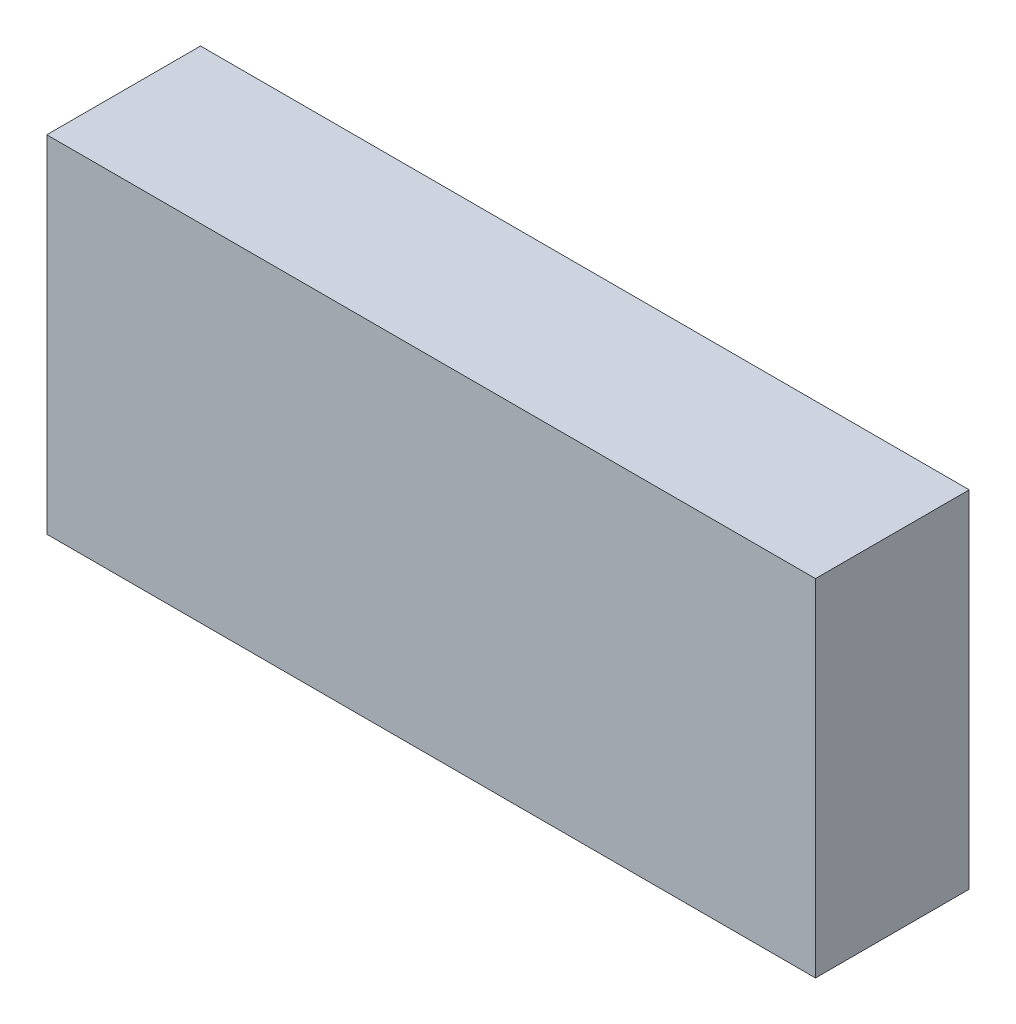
from build123d import *

# Parameters (mm, degrees)
ESQUISSE1_W      = 40
ESQUISSE1_H      = 18
EXTRUSION1_DEPTH = 8


with BuildPart() as part:
    # Esquisse1 → Extrusion1 (new body)
    with BuildSketch(Plane.XY):
        with Locations((20, 9)):
            Rectangle(ESQUISSE1_W, ESQUISSE1_H)
    extrude(amount=EXTRUSION1_DEPTH)


solid = part.part
